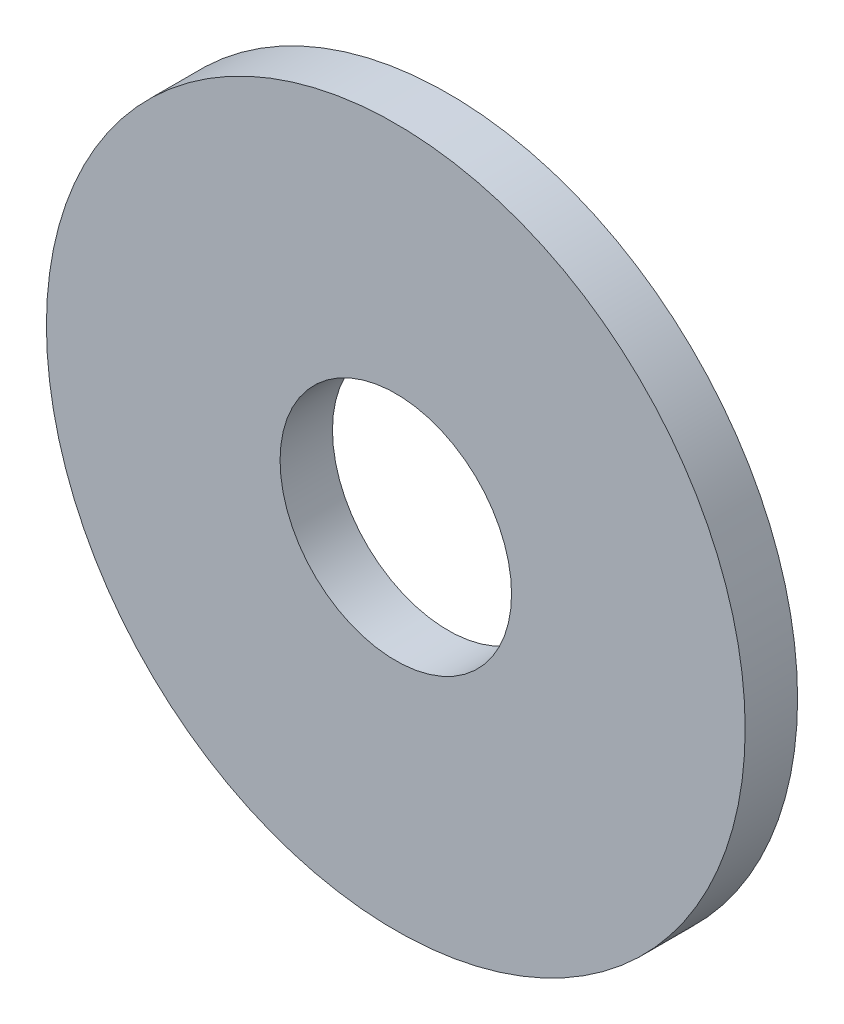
ISO-10303-21;
HEADER;
FILE_DESCRIPTION(('STEP AP214'),'2;1');
FILE_NAME('part.step','',(''),(''),'','','');
FILE_SCHEMA(('AUTOMOTIVE_DESIGN { 1 0 10303 214 1 1 1 1 }'));
ENDSEC;
DATA;
#1=APPLICATION_CONTEXT('core data for automotive mechanical design processes');
#2=APPLICATION_PROTOCOL_DEFINITION('international standard','automotive_design',2000,#1);
#3=PRODUCT_CONTEXT('',#1,'mechanical');
#4=PRODUCT('Part','Part','',(#3));
#5=PRODUCT_RELATED_PRODUCT_CATEGORY('part','',(#4));
#6=PRODUCT_DEFINITION_FORMATION('','',#4);
#7=PRODUCT_DEFINITION_CONTEXT('part definition',#1,'design');
#8=PRODUCT_DEFINITION('design','',#6,#7);
#9=PRODUCT_DEFINITION_SHAPE('','',#8);
#10=(LENGTH_UNIT() NAMED_UNIT(*) SI_UNIT(.MILLI.,.METRE.));
#11=(NAMED_UNIT(*) PLANE_ANGLE_UNIT() SI_UNIT($,.RADIAN.));
#12=(NAMED_UNIT(*) SI_UNIT($,.STERADIAN.) SOLID_ANGLE_UNIT());
#13=UNCERTAINTY_MEASURE_WITH_UNIT(LENGTH_MEASURE(1.E-05),#10,'distance_accuracy_value','');
#14=(GEOMETRIC_REPRESENTATION_CONTEXT(3) GLOBAL_UNCERTAINTY_ASSIGNED_CONTEXT((#13)) GLOBAL_UNIT_ASSIGNED_CONTEXT((#10,
#11,#12)) REPRESENTATION_CONTEXT('',''));
#15=CARTESIAN_POINT('',(0.,0.,0.));
#16=DIRECTION('',(0.,0.,1.));
#17=DIRECTION('',(1.,0.,0.));
#18=AXIS2_PLACEMENT_3D('',#15,#16,#17);
#19=CARTESIAN_POINT('',(0.,0.,1.2));
#20=DIRECTION('',(0.,0.,1.));
#21=DIRECTION('',(1.,0.,0.));
#22=AXIS2_PLACEMENT_3D('',#19,#20,#21);
#23=PLANE('',#22);
#24=CARTESIAN_POINT('',(0.,0.,1.2));
#25=DIRECTION('',(0.,0.,1.));
#26=DIRECTION('',(1.,0.,0.));
#27=AXIS2_PLACEMENT_3D('',#24,#25,#26);
#28=CIRCLE('',#27,8.);
#29=CARTESIAN_POINT('',(8.,0.,1.2));
#30=VERTEX_POINT('',#29);
#31=EDGE_CURVE('E10',#30,#30,#28,.T.);
#32=ORIENTED_EDGE('',*,*,#31,.T.);
#33=EDGE_LOOP('',(#32));
#34=FACE_BOUND('',#33,.T.);
#35=CARTESIAN_POINT('',(0.,0.,1.2));
#36=DIRECTION('',(0.,0.,1.));
#37=DIRECTION('',(1.,0.,0.));
#38=AXIS2_PLACEMENT_3D('',#35,#36,#37);
#39=CIRCLE('',#38,2.65);
#40=CARTESIAN_POINT('',(2.65,0.,1.2));
#41=VERTEX_POINT('',#40);
#42=EDGE_CURVE('E40',#41,#41,#39,.T.);
#43=ORIENTED_EDGE('',*,*,#42,.F.);
#44=EDGE_LOOP('',(#43));
#45=FACE_BOUND('',#44,.T.);
#46=ADVANCED_FACE('F29',(#34,#45),#23,.T.);
#47=CARTESIAN_POINT('',(0.,0.,0.));
#48=DIRECTION('',(0.,0.,1.));
#49=DIRECTION('',(1.,0.,0.));
#50=AXIS2_PLACEMENT_3D('',#47,#48,#49);
#51=PLANE('',#50);
#52=CARTESIAN_POINT('',(0.,0.,0.));
#53=DIRECTION('',(0.,0.,1.));
#54=DIRECTION('',(1.,0.,0.));
#55=AXIS2_PLACEMENT_3D('',#52,#53,#54);
#56=CIRCLE('',#55,8.);
#57=CARTESIAN_POINT('',(8.,0.,0.));
#58=VERTEX_POINT('',#57);
#59=EDGE_CURVE('E36',#58,#58,#56,.T.);
#60=ORIENTED_EDGE('',*,*,#59,.F.);
#61=EDGE_LOOP('',(#60));
#62=FACE_BOUND('',#61,.T.);
#63=CARTESIAN_POINT('',(0.,0.,0.));
#64=DIRECTION('',(0.,0.,1.));
#65=DIRECTION('',(1.,0.,0.));
#66=AXIS2_PLACEMENT_3D('',#63,#64,#65);
#67=CIRCLE('',#66,2.65);
#68=CARTESIAN_POINT('',(2.65,0.,0.));
#69=VERTEX_POINT('',#68);
#70=EDGE_CURVE('E44',#69,#69,#67,.T.);
#71=ORIENTED_EDGE('',*,*,#70,.T.);
#72=EDGE_LOOP('',(#71));
#73=FACE_BOUND('',#72,.T.);
#74=ADVANCED_FACE('F50',(#62,#73),#51,.F.);
#75=CARTESIAN_POINT('',(0.,0.,1.2));
#76=DIRECTION('',(0.,0.,-1.));
#77=DIRECTION('',(-1.,0.,0.));
#78=AXIS2_PLACEMENT_3D('',#75,#76,#77);
#79=CYLINDRICAL_SURFACE('',#78,8.);
#80=ORIENTED_EDGE('',*,*,#31,.F.);
#81=EDGE_LOOP('',(#80));
#82=FACE_BOUND('',#81,.T.);
#83=ORIENTED_EDGE('',*,*,#59,.T.);
#84=EDGE_LOOP('',(#83));
#85=FACE_BOUND('',#84,.T.);
#86=ADVANCED_FACE('F31',(#82,#85),#79,.T.);
#87=CARTESIAN_POINT('',(0.,0.,1.2));
#88=DIRECTION('',(0.,0.,-1.));
#89=DIRECTION('',(-1.,0.,0.));
#90=AXIS2_PLACEMENT_3D('',#87,#88,#89);
#91=CYLINDRICAL_SURFACE('',#90,2.65);
#92=ORIENTED_EDGE('',*,*,#42,.T.);
#93=EDGE_LOOP('',(#92));
#94=FACE_BOUND('',#93,.T.);
#95=ORIENTED_EDGE('',*,*,#70,.F.);
#96=EDGE_LOOP('',(#95));
#97=FACE_BOUND('',#96,.T.);
#98=ADVANCED_FACE('F52',(#94,#97),#91,.F.);
#99=CLOSED_SHELL('',(#46,#74,#86,#98));
#100=MANIFOLD_SOLID_BREP('B2',#99);
#101=ADVANCED_BREP_SHAPE_REPRESENTATION('',(#18,#100),#14);
#102=SHAPE_DEFINITION_REPRESENTATION(#9,#101);
ENDSEC;
END-ISO-10303-21;
